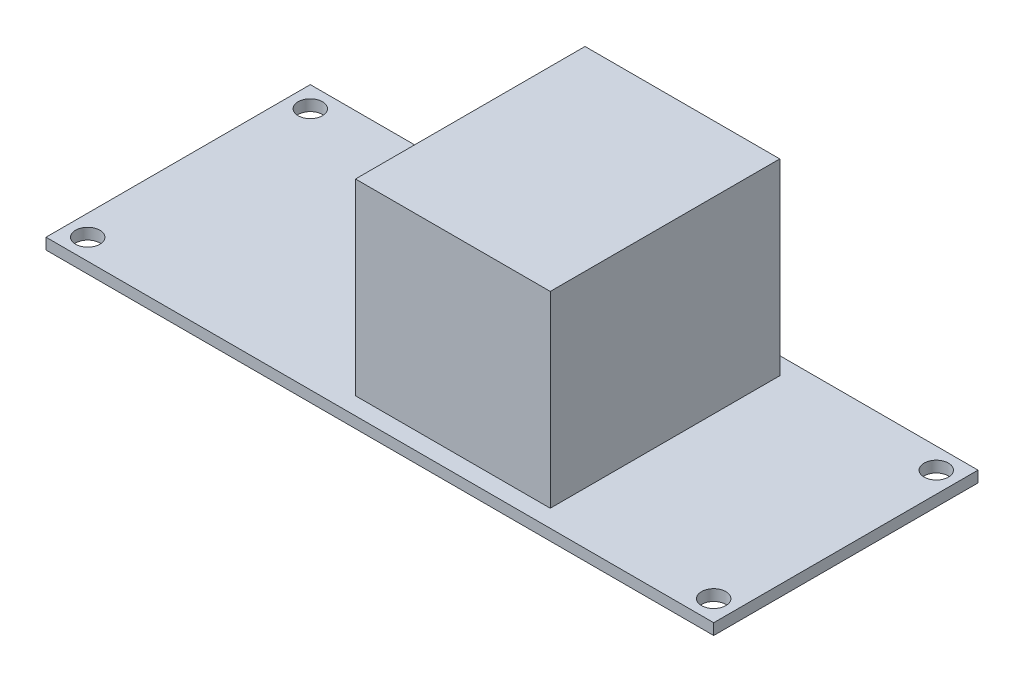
ISO-10303-21;
HEADER;
FILE_DESCRIPTION(('STEP AP214'),'2;1');
FILE_NAME('part.step','',(''),(''),'','','');
FILE_SCHEMA(('AUTOMOTIVE_DESIGN { 1 0 10303 214 1 1 1 1 }'));
ENDSEC;
DATA;
#1=APPLICATION_CONTEXT('core data for automotive mechanical design processes');
#2=APPLICATION_PROTOCOL_DEFINITION('international standard','automotive_design',2000,#1);
#3=PRODUCT_CONTEXT('',#1,'mechanical');
#4=PRODUCT('Part','Part','',(#3));
#5=PRODUCT_RELATED_PRODUCT_CATEGORY('part','',(#4));
#6=PRODUCT_DEFINITION_FORMATION('','',#4);
#7=PRODUCT_DEFINITION_CONTEXT('part definition',#1,'design');
#8=PRODUCT_DEFINITION('design','',#6,#7);
#9=PRODUCT_DEFINITION_SHAPE('','',#8);
#10=(LENGTH_UNIT() NAMED_UNIT(*) SI_UNIT(.MILLI.,.METRE.));
#11=(NAMED_UNIT(*) PLANE_ANGLE_UNIT() SI_UNIT($,.RADIAN.));
#12=(NAMED_UNIT(*) SI_UNIT($,.STERADIAN.) SOLID_ANGLE_UNIT());
#13=UNCERTAINTY_MEASURE_WITH_UNIT(LENGTH_MEASURE(1.E-05),#10,'distance_accuracy_value','');
#14=(GEOMETRIC_REPRESENTATION_CONTEXT(3) GLOBAL_UNCERTAINTY_ASSIGNED_CONTEXT((#13)) GLOBAL_UNIT_ASSIGNED_CONTEXT((#10,
#11,#12)) REPRESENTATION_CONTEXT('',''));
#15=CARTESIAN_POINT('',(0.,0.,0.));
#16=DIRECTION('',(0.,0.,1.));
#17=DIRECTION('',(1.,0.,0.));
#18=AXIS2_PLACEMENT_3D('',#15,#16,#17);
#19=CARTESIAN_POINT('',(0.,1.6,0.));
#20=DIRECTION('',(0.,1.,0.));
#21=DIRECTION('',(0.,0.,1.));
#22=AXIS2_PLACEMENT_3D('',#19,#20,#21);
#23=PLANE('',#22);
#24=CARTESIAN_POINT('',(45.,1.6,16.));
#25=DIRECTION('',(0.,1.,0.));
#26=DIRECTION('',(0.,0.,1.));
#27=AXIS2_PLACEMENT_3D('',#24,#25,#26);
#28=CIRCLE('',#27,1.75);
#29=CARTESIAN_POINT('',(45.,1.6,17.75));
#30=VERTEX_POINT('',#29);
#31=EDGE_CURVE('E145',#30,#30,#28,.T.);
#32=ORIENTED_EDGE('',*,*,#31,.F.);
#33=EDGE_LOOP('',(#32));
#34=FACE_BOUND('',#33,.T.);
#35=CARTESIAN_POINT('',(-45.,1.6,-16.));
#36=DIRECTION('',(0.,1.,0.));
#37=DIRECTION('',(0.,0.,1.));
#38=AXIS2_PLACEMENT_3D('',#35,#36,#37);
#39=CIRCLE('',#38,1.75);
#40=CARTESIAN_POINT('',(-45.,1.6,-14.25));
#41=VERTEX_POINT('',#40);
#42=EDGE_CURVE('E157',#41,#41,#39,.T.);
#43=ORIENTED_EDGE('',*,*,#42,.F.);
#44=EDGE_LOOP('',(#43));
#45=FACE_BOUND('',#44,.T.);
#46=DIRECTION('',(0.,0.,-1.));
#47=VECTOR('',#46,1.);
#48=CARTESIAN_POINT('',(48.,1.6,-19.));
#49=LINE('',#48,#47);
#50=CARTESIAN_POINT('',(48.,1.6,19.));
#51=VERTEX_POINT('',#50);
#52=CARTESIAN_POINT('',(48.,1.6,-19.));
#53=VERTEX_POINT('',#52);
#54=EDGE_CURVE('E163',#51,#53,#49,.T.);
#55=ORIENTED_EDGE('',*,*,#54,.T.);
#56=DIRECTION('',(-1.,0.,0.));
#57=VECTOR('',#56,1.);
#58=CARTESIAN_POINT('',(-48.,1.6,-19.));
#59=LINE('',#58,#57);
#60=CARTESIAN_POINT('',(-48.,1.6,-19.));
#61=VERTEX_POINT('',#60);
#62=EDGE_CURVE('E87',#53,#61,#59,.T.);
#63=ORIENTED_EDGE('',*,*,#62,.T.);
#64=DIRECTION('',(0.,0.,1.));
#65=VECTOR('',#64,1.);
#66=CARTESIAN_POINT('',(-48.,1.6,-19.));
#67=LINE('',#66,#65);
#68=CARTESIAN_POINT('',(-48.,1.6,19.));
#69=VERTEX_POINT('',#68);
#70=EDGE_CURVE('E166',#61,#69,#67,.T.);
#71=ORIENTED_EDGE('',*,*,#70,.T.);
#72=DIRECTION('',(1.,0.,0.));
#73=VECTOR('',#72,1.);
#74=CARTESIAN_POINT('',(-48.,1.6,19.));
#75=LINE('',#74,#73);
#76=EDGE_CURVE('E59',#69,#51,#75,.T.);
#77=ORIENTED_EDGE('',*,*,#76,.T.);
#78=EDGE_LOOP('',(#55,#63,#71,#77));
#79=FACE_BOUND('',#78,.T.);
#80=CARTESIAN_POINT('',(-45.,1.6,16.));
#81=DIRECTION('',(0.,1.,0.));
#82=DIRECTION('',(0.,0.,1.));
#83=AXIS2_PLACEMENT_3D('',#80,#81,#82);
#84=CIRCLE('',#83,1.75);
#85=CARTESIAN_POINT('',(-45.,1.6,17.75));
#86=VERTEX_POINT('',#85);
#87=EDGE_CURVE('E151',#86,#86,#84,.T.);
#88=ORIENTED_EDGE('',*,*,#87,.F.);
#89=EDGE_LOOP('',(#88));
#90=FACE_BOUND('',#89,.T.);
#91=CARTESIAN_POINT('',(45.,1.6,-16.));
#92=DIRECTION('',(0.,1.,0.));
#93=DIRECTION('',(0.,0.,1.));
#94=AXIS2_PLACEMENT_3D('',#91,#92,#93);
#95=CIRCLE('',#94,1.75);
#96=CARTESIAN_POINT('',(45.,1.6,-14.25));
#97=VERTEX_POINT('',#96);
#98=EDGE_CURVE('E137',#97,#97,#95,.T.);
#99=ORIENTED_EDGE('',*,*,#98,.F.);
#100=EDGE_LOOP('',(#99));
#101=FACE_BOUND('',#100,.T.);
#102=DIRECTION('',(-1.,0.,0.));
#103=VECTOR('',#102,1.);
#104=CARTESIAN_POINT('',(-6.00000000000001,1.6,-16.5));
#105=LINE('',#104,#103);
#106=CARTESIAN_POINT('',(22.,1.6,-16.5));
#107=VERTEX_POINT('',#106);
#108=CARTESIAN_POINT('',(-6.00000000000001,1.6,-16.5));
#109=VERTEX_POINT('',#108);
#110=EDGE_CURVE('E333',#107,#109,#105,.T.);
#111=ORIENTED_EDGE('',*,*,#110,.F.);
#112=DIRECTION('',(0.,0.,-1.));
#113=VECTOR('',#112,1.);
#114=CARTESIAN_POINT('',(22.,1.6,-16.5));
#115=LINE('',#114,#113);
#116=CARTESIAN_POINT('',(22.,1.6,16.5));
#117=VERTEX_POINT('',#116);
#118=EDGE_CURVE('E132',#117,#107,#115,.T.);
#119=ORIENTED_EDGE('',*,*,#118,.F.);
#120=DIRECTION('',(1.,0.,0.));
#121=VECTOR('',#120,1.);
#122=CARTESIAN_POINT('',(-6.,1.6,16.5));
#123=LINE('',#122,#121);
#124=CARTESIAN_POINT('',(-6.,1.6,16.5));
#125=VERTEX_POINT('',#124);
#126=EDGE_CURVE('E128',#125,#117,#123,.T.);
#127=ORIENTED_EDGE('',*,*,#126,.F.);
#128=DIRECTION('',(0.,0.,1.));
#129=VECTOR('',#128,1.);
#130=CARTESIAN_POINT('',(-6.00000000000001,1.6,-16.5));
#131=LINE('',#130,#129);
#132=EDGE_CURVE('E330',#109,#125,#131,.T.);
#133=ORIENTED_EDGE('',*,*,#132,.F.);
#134=EDGE_LOOP('',(#111,#119,#127,#133));
#135=FACE_BOUND('',#134,.T.);
#136=ADVANCED_FACE('F35',(#34,#45,#79,#90,#101,#135),#23,.T.);
#137=CARTESIAN_POINT('',(0.,0.,0.));
#138=DIRECTION('',(0.,1.,0.));
#139=DIRECTION('',(0.,0.,1.));
#140=AXIS2_PLACEMENT_3D('',#137,#138,#139);
#141=PLANE('',#140);
#142=DIRECTION('',(0.,0.,-1.));
#143=VECTOR('',#142,1.);
#144=CARTESIAN_POINT('',(48.,0.,-19.));
#145=LINE('',#144,#143);
#146=CARTESIAN_POINT('',(48.,0.,19.));
#147=VERTEX_POINT('',#146);
#148=CARTESIAN_POINT('',(48.,0.,-19.));
#149=VERTEX_POINT('',#148);
#150=EDGE_CURVE('E160',#147,#149,#145,.T.);
#151=ORIENTED_EDGE('',*,*,#150,.F.);
#152=DIRECTION('',(1.,0.,0.));
#153=VECTOR('',#152,1.);
#154=CARTESIAN_POINT('',(-48.,0.,19.));
#155=LINE('',#154,#153);
#156=CARTESIAN_POINT('',(-48.,0.,19.));
#157=VERTEX_POINT('',#156);
#158=EDGE_CURVE('E80',#157,#147,#155,.T.);
#159=ORIENTED_EDGE('',*,*,#158,.F.);
#160=DIRECTION('',(0.,0.,1.));
#161=VECTOR('',#160,1.);
#162=CARTESIAN_POINT('',(-48.,0.,-19.));
#163=LINE('',#162,#161);
#164=CARTESIAN_POINT('',(-48.,0.,-19.));
#165=VERTEX_POINT('',#164);
#166=EDGE_CURVE('E174',#165,#157,#163,.T.);
#167=ORIENTED_EDGE('',*,*,#166,.F.);
#168=DIRECTION('',(-1.,0.,0.));
#169=VECTOR('',#168,1.);
#170=CARTESIAN_POINT('',(-48.,0.,-19.));
#171=LINE('',#170,#169);
#172=EDGE_CURVE('E172',#149,#165,#171,.T.);
#173=ORIENTED_EDGE('',*,*,#172,.F.);
#174=EDGE_LOOP('',(#151,#159,#167,#173));
#175=FACE_BOUND('',#174,.T.);
#176=CARTESIAN_POINT('',(-45.,0.,-16.));
#177=DIRECTION('',(0.,1.,0.));
#178=DIRECTION('',(0.,0.,1.));
#179=AXIS2_PLACEMENT_3D('',#176,#177,#178);
#180=CIRCLE('',#179,1.75);
#181=CARTESIAN_POINT('',(-45.,0.,-14.25));
#182=VERTEX_POINT('',#181);
#183=EDGE_CURVE('E154',#182,#182,#180,.T.);
#184=ORIENTED_EDGE('',*,*,#183,.T.);
#185=EDGE_LOOP('',(#184));
#186=FACE_BOUND('',#185,.T.);
#187=CARTESIAN_POINT('',(-45.,0.,16.));
#188=DIRECTION('',(0.,1.,0.));
#189=DIRECTION('',(0.,0.,1.));
#190=AXIS2_PLACEMENT_3D('',#187,#188,#189);
#191=CIRCLE('',#190,1.75);
#192=CARTESIAN_POINT('',(-45.,0.,17.75));
#193=VERTEX_POINT('',#192);
#194=EDGE_CURVE('E148',#193,#193,#191,.T.);
#195=ORIENTED_EDGE('',*,*,#194,.T.);
#196=EDGE_LOOP('',(#195));
#197=FACE_BOUND('',#196,.T.);
#198=CARTESIAN_POINT('',(45.,0.,16.));
#199=DIRECTION('',(0.,1.,0.));
#200=DIRECTION('',(0.,0.,1.));
#201=AXIS2_PLACEMENT_3D('',#198,#199,#200);
#202=CIRCLE('',#201,1.75);
#203=CARTESIAN_POINT('',(45.,0.,17.75));
#204=VERTEX_POINT('',#203);
#205=EDGE_CURVE('E143',#204,#204,#202,.T.);
#206=ORIENTED_EDGE('',*,*,#205,.T.);
#207=EDGE_LOOP('',(#206));
#208=FACE_BOUND('',#207,.T.);
#209=CARTESIAN_POINT('',(45.,0.,-16.));
#210=DIRECTION('',(0.,1.,0.));
#211=DIRECTION('',(0.,0.,1.));
#212=AXIS2_PLACEMENT_3D('',#209,#210,#211);
#213=CIRCLE('',#212,1.75);
#214=CARTESIAN_POINT('',(45.,0.,-14.25));
#215=VERTEX_POINT('',#214);
#216=EDGE_CURVE('E134',#215,#215,#213,.T.);
#217=ORIENTED_EDGE('',*,*,#216,.T.);
#218=EDGE_LOOP('',(#217));
#219=FACE_BOUND('',#218,.T.);
#220=ADVANCED_FACE('F187',(#175,#186,#197,#208,#219),#141,.F.);
#221=CARTESIAN_POINT('',(48.,1.6,-19.));
#222=DIRECTION('',(-1.,0.,0.));
#223=DIRECTION('',(0.,0.,1.));
#224=AXIS2_PLACEMENT_3D('',#221,#222,#223);
#225=PLANE('',#224);
#226=ORIENTED_EDGE('',*,*,#150,.T.);
#227=DIRECTION('',(0.,-1.,0.));
#228=VECTOR('',#227,1.);
#229=CARTESIAN_POINT('',(48.,1.6,-19.));
#230=LINE('',#229,#228);
#231=EDGE_CURVE('E11',#53,#149,#230,.T.);
#232=ORIENTED_EDGE('',*,*,#231,.F.);
#233=ORIENTED_EDGE('',*,*,#54,.F.);
#234=DIRECTION('',(0.,-1.,0.));
#235=VECTOR('',#234,1.);
#236=CARTESIAN_POINT('',(48.,1.6,19.));
#237=LINE('',#236,#235);
#238=EDGE_CURVE('E169',#51,#147,#237,.T.);
#239=ORIENTED_EDGE('',*,*,#238,.T.);
#240=EDGE_LOOP('',(#226,#232,#233,#239));
#241=FACE_BOUND('',#240,.T.);
#242=ADVANCED_FACE('F37',(#241),#225,.F.);
#243=CARTESIAN_POINT('',(-48.,1.6,-19.));
#244=DIRECTION('',(0.,0.,1.));
#245=DIRECTION('',(1.,0.,0.));
#246=AXIS2_PLACEMENT_3D('',#243,#244,#245);
#247=PLANE('',#246);
#248=ORIENTED_EDGE('',*,*,#172,.T.);
#249=DIRECTION('',(0.,-1.,0.));
#250=VECTOR('',#249,1.);
#251=CARTESIAN_POINT('',(-48.,1.6,-19.));
#252=LINE('',#251,#250);
#253=EDGE_CURVE('E43',#61,#165,#252,.T.);
#254=ORIENTED_EDGE('',*,*,#253,.F.);
#255=ORIENTED_EDGE('',*,*,#62,.F.);
#256=ORIENTED_EDGE('',*,*,#231,.T.);
#257=EDGE_LOOP('',(#248,#254,#255,#256));
#258=FACE_BOUND('',#257,.T.);
#259=ADVANCED_FACE('F203',(#258),#247,.F.);
#260=CARTESIAN_POINT('',(-48.,1.6,-19.));
#261=DIRECTION('',(1.,0.,0.));
#262=DIRECTION('',(0.,0.,-1.));
#263=AXIS2_PLACEMENT_3D('',#260,#261,#262);
#264=PLANE('',#263);
#265=ORIENTED_EDGE('',*,*,#166,.T.);
#266=DIRECTION('',(0.,-1.,0.));
#267=VECTOR('',#266,1.);
#268=CARTESIAN_POINT('',(-48.,1.6,19.));
#269=LINE('',#268,#267);
#270=EDGE_CURVE('E178',#69,#157,#269,.T.);
#271=ORIENTED_EDGE('',*,*,#270,.F.);
#272=ORIENTED_EDGE('',*,*,#70,.F.);
#273=ORIENTED_EDGE('',*,*,#253,.T.);
#274=EDGE_LOOP('',(#265,#271,#272,#273));
#275=FACE_BOUND('',#274,.T.);
#276=ADVANCED_FACE('F183',(#275),#264,.F.);
#277=CARTESIAN_POINT('',(-48.,1.6,19.));
#278=DIRECTION('',(0.,0.,-1.));
#279=DIRECTION('',(-1.,0.,0.));
#280=AXIS2_PLACEMENT_3D('',#277,#278,#279);
#281=PLANE('',#280);
#282=ORIENTED_EDGE('',*,*,#158,.T.);
#283=ORIENTED_EDGE('',*,*,#238,.F.);
#284=ORIENTED_EDGE('',*,*,#76,.F.);
#285=ORIENTED_EDGE('',*,*,#270,.T.);
#286=EDGE_LOOP('',(#282,#283,#284,#285));
#287=FACE_BOUND('',#286,.T.);
#288=ADVANCED_FACE('F192',(#287),#281,.F.);
#289=CARTESIAN_POINT('',(-45.,1.6,-16.));
#290=DIRECTION('',(0.,-1.,0.));
#291=DIRECTION('',(0.,0.,-1.));
#292=AXIS2_PLACEMENT_3D('',#289,#290,#291);
#293=CYLINDRICAL_SURFACE('',#292,1.75);
#294=ORIENTED_EDGE('',*,*,#42,.T.);
#295=EDGE_LOOP('',(#294));
#296=FACE_BOUND('',#295,.T.);
#297=ORIENTED_EDGE('',*,*,#183,.F.);
#298=EDGE_LOOP('',(#297));
#299=FACE_BOUND('',#298,.T.);
#300=ADVANCED_FACE('F194',(#296,#299),#293,.F.);
#301=CARTESIAN_POINT('',(-45.,1.6,16.));
#302=DIRECTION('',(0.,-1.,0.));
#303=DIRECTION('',(0.,0.,-1.));
#304=AXIS2_PLACEMENT_3D('',#301,#302,#303);
#305=CYLINDRICAL_SURFACE('',#304,1.75);
#306=ORIENTED_EDGE('',*,*,#87,.T.);
#307=EDGE_LOOP('',(#306));
#308=FACE_BOUND('',#307,.T.);
#309=ORIENTED_EDGE('',*,*,#194,.F.);
#310=EDGE_LOOP('',(#309));
#311=FACE_BOUND('',#310,.T.);
#312=ADVANCED_FACE('F200',(#308,#311),#305,.F.);
#313=CARTESIAN_POINT('',(45.,1.6,16.));
#314=DIRECTION('',(0.,-1.,0.));
#315=DIRECTION('',(0.,0.,-1.));
#316=AXIS2_PLACEMENT_3D('',#313,#314,#315);
#317=CYLINDRICAL_SURFACE('',#316,1.75);
#318=ORIENTED_EDGE('',*,*,#31,.T.);
#319=EDGE_LOOP('',(#318));
#320=FACE_BOUND('',#319,.T.);
#321=ORIENTED_EDGE('',*,*,#205,.F.);
#322=EDGE_LOOP('',(#321));
#323=FACE_BOUND('',#322,.T.);
#324=ADVANCED_FACE('F217',(#320,#323),#317,.F.);
#325=CARTESIAN_POINT('',(45.,1.6,-16.));
#326=DIRECTION('',(0.,-1.,0.));
#327=DIRECTION('',(0.,0.,-1.));
#328=AXIS2_PLACEMENT_3D('',#325,#326,#327);
#329=CYLINDRICAL_SURFACE('',#328,1.75);
#330=ORIENTED_EDGE('',*,*,#98,.T.);
#331=EDGE_LOOP('',(#330));
#332=FACE_BOUND('',#331,.T.);
#333=ORIENTED_EDGE('',*,*,#216,.F.);
#334=EDGE_LOOP('',(#333));
#335=FACE_BOUND('',#334,.T.);
#336=ADVANCED_FACE('F221',(#332,#335),#329,.F.);
#337=CARTESIAN_POINT('',(22.,28.6,-16.5));
#338=DIRECTION('',(-1.,0.,0.));
#339=DIRECTION('',(0.,0.,1.));
#340=AXIS2_PLACEMENT_3D('',#337,#338,#339);
#341=PLANE('',#340);
#342=ORIENTED_EDGE('',*,*,#118,.T.);
#343=DIRECTION('',(0.,-1.,0.));
#344=VECTOR('',#343,1.);
#345=CARTESIAN_POINT('',(22.,28.6,-16.5));
#346=LINE('',#345,#344);
#347=CARTESIAN_POINT('',(22.,28.6,-16.5));
#348=VERTEX_POINT('',#347);
#349=EDGE_CURVE('E113',#348,#107,#346,.T.);
#350=ORIENTED_EDGE('',*,*,#349,.F.);
#351=DIRECTION('',(0.,0.,-1.));
#352=VECTOR('',#351,1.);
#353=CARTESIAN_POINT('',(22.,28.6,-16.5));
#354=LINE('',#353,#352);
#355=CARTESIAN_POINT('',(22.,28.6,16.5));
#356=VERTEX_POINT('',#355);
#357=EDGE_CURVE('E120',#356,#348,#354,.T.);
#358=ORIENTED_EDGE('',*,*,#357,.F.);
#359=DIRECTION('',(0.,-1.,0.));
#360=VECTOR('',#359,1.);
#361=CARTESIAN_POINT('',(22.,28.6,16.5));
#362=LINE('',#361,#360);
#363=EDGE_CURVE('E327',#356,#117,#362,.T.);
#364=ORIENTED_EDGE('',*,*,#363,.T.);
#365=EDGE_LOOP('',(#342,#350,#358,#364));
#366=FACE_BOUND('',#365,.T.);
#367=ADVANCED_FACE('F130',(#366),#341,.F.);
#368=CARTESIAN_POINT('',(-6.00000000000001,28.6,-16.5));
#369=DIRECTION('',(0.,0.,1.));
#370=DIRECTION('',(1.,0.,0.));
#371=AXIS2_PLACEMENT_3D('',#368,#369,#370);
#372=PLANE('',#371);
#373=ORIENTED_EDGE('',*,*,#110,.T.);
#374=DIRECTION('',(0.,-1.,0.));
#375=VECTOR('',#374,1.);
#376=CARTESIAN_POINT('',(-6.00000000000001,28.6,-16.5));
#377=LINE('',#376,#375);
#378=CARTESIAN_POINT('',(-6.00000000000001,28.6,-16.5));
#379=VERTEX_POINT('',#378);
#380=EDGE_CURVE('E116',#379,#109,#377,.T.);
#381=ORIENTED_EDGE('',*,*,#380,.F.);
#382=DIRECTION('',(-1.,0.,0.));
#383=VECTOR('',#382,1.);
#384=CARTESIAN_POINT('',(-6.00000000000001,28.6,-16.5));
#385=LINE('',#384,#383);
#386=EDGE_CURVE('E109',#348,#379,#385,.T.);
#387=ORIENTED_EDGE('',*,*,#386,.F.);
#388=ORIENTED_EDGE('',*,*,#349,.T.);
#389=EDGE_LOOP('',(#373,#381,#387,#388));
#390=FACE_BOUND('',#389,.T.);
#391=ADVANCED_FACE('F111',(#390),#372,.F.);
#392=CARTESIAN_POINT('',(-6.00000000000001,28.6,-16.5));
#393=DIRECTION('',(1.,0.,0.));
#394=DIRECTION('',(0.,0.,-1.));
#395=AXIS2_PLACEMENT_3D('',#392,#393,#394);
#396=PLANE('',#395);
#397=ORIENTED_EDGE('',*,*,#132,.T.);
#398=DIRECTION('',(0.,-1.,0.));
#399=VECTOR('',#398,1.);
#400=CARTESIAN_POINT('',(-6.,28.6,16.5));
#401=LINE('',#400,#399);
#402=CARTESIAN_POINT('',(-6.,28.6,16.5));
#403=VERTEX_POINT('',#402);
#404=EDGE_CURVE('E50',#403,#125,#401,.T.);
#405=ORIENTED_EDGE('',*,*,#404,.F.);
#406=DIRECTION('',(0.,0.,1.));
#407=VECTOR('',#406,1.);
#408=CARTESIAN_POINT('',(-6.00000000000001,28.6,-16.5));
#409=LINE('',#408,#407);
#410=EDGE_CURVE('E119',#379,#403,#409,.T.);
#411=ORIENTED_EDGE('',*,*,#410,.F.);
#412=ORIENTED_EDGE('',*,*,#380,.T.);
#413=EDGE_LOOP('',(#397,#405,#411,#412));
#414=FACE_BOUND('',#413,.T.);
#415=ADVANCED_FACE('F230',(#414),#396,.F.);
#416=CARTESIAN_POINT('',(-6.,28.6,16.5));
#417=DIRECTION('',(0.,0.,-1.));
#418=DIRECTION('',(-1.,0.,0.));
#419=AXIS2_PLACEMENT_3D('',#416,#417,#418);
#420=PLANE('',#419);
#421=ORIENTED_EDGE('',*,*,#126,.T.);
#422=ORIENTED_EDGE('',*,*,#363,.F.);
#423=DIRECTION('',(1.,0.,0.));
#424=VECTOR('',#423,1.);
#425=CARTESIAN_POINT('',(-6.,28.6,16.5));
#426=LINE('',#425,#424);
#427=EDGE_CURVE('E124',#403,#356,#426,.T.);
#428=ORIENTED_EDGE('',*,*,#427,.F.);
#429=ORIENTED_EDGE('',*,*,#404,.T.);
#430=EDGE_LOOP('',(#421,#422,#428,#429));
#431=FACE_BOUND('',#430,.T.);
#432=ADVANCED_FACE('F233',(#431),#420,.F.);
#433=CARTESIAN_POINT('',(0.,28.6,0.));
#434=DIRECTION('',(0.,1.,0.));
#435=DIRECTION('',(0.,0.,1.));
#436=AXIS2_PLACEMENT_3D('',#433,#434,#435);
#437=PLANE('',#436);
#438=ORIENTED_EDGE('',*,*,#357,.T.);
#439=ORIENTED_EDGE('',*,*,#386,.T.);
#440=ORIENTED_EDGE('',*,*,#410,.T.);
#441=ORIENTED_EDGE('',*,*,#427,.T.);
#442=EDGE_LOOP('',(#438,#439,#440,#441));
#443=FACE_BOUND('',#442,.T.);
#444=ADVANCED_FACE('F123',(#443),#437,.T.);
#445=CLOSED_SHELL('',(#136,#220,#242,#259,#276,#288,#300,#312,#324,#336,#367,#391,#415,#432,#444));
#446=MANIFOLD_SOLID_BREP('B2',#445);
#447=ADVANCED_BREP_SHAPE_REPRESENTATION('',(#18,#446),#14);
#448=SHAPE_DEFINITION_REPRESENTATION(#9,#447);
ENDSEC;
END-ISO-10303-21;
